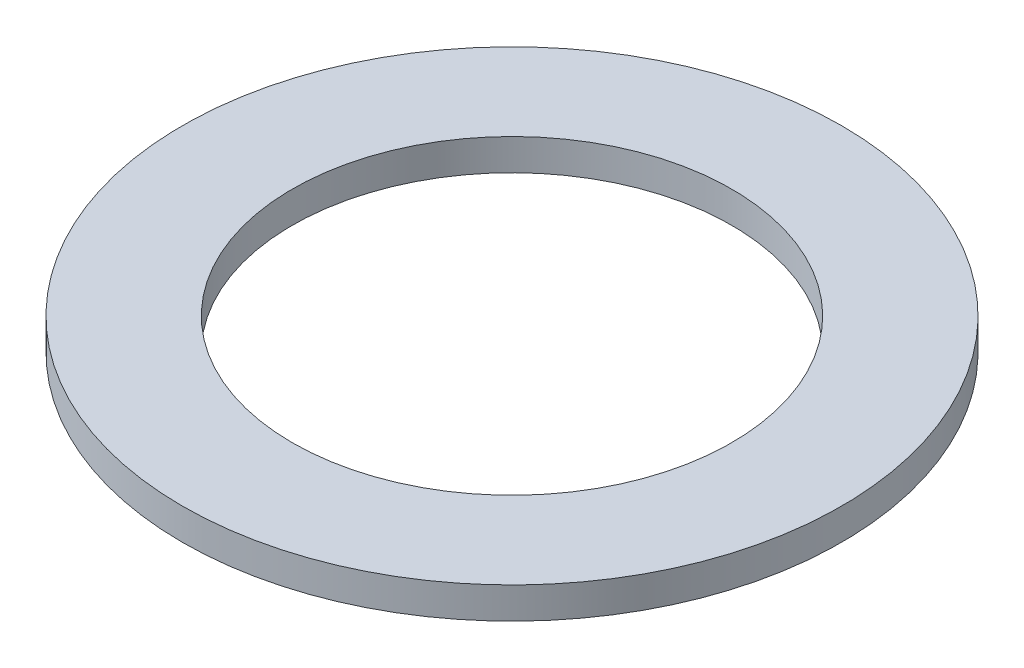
ISO-10303-21;
HEADER;
FILE_DESCRIPTION(('STEP AP214'),'2;1');
FILE_NAME('part.step','',(''),(''),'','','');
FILE_SCHEMA(('AUTOMOTIVE_DESIGN { 1 0 10303 214 1 1 1 1 }'));
ENDSEC;
DATA;
#1=APPLICATION_CONTEXT('core data for automotive mechanical design processes');
#2=APPLICATION_PROTOCOL_DEFINITION('international standard','automotive_design',2000,#1);
#3=PRODUCT_CONTEXT('',#1,'mechanical');
#4=PRODUCT('Part','Part','',(#3));
#5=PRODUCT_RELATED_PRODUCT_CATEGORY('part','',(#4));
#6=PRODUCT_DEFINITION_FORMATION('','',#4);
#7=PRODUCT_DEFINITION_CONTEXT('part definition',#1,'design');
#8=PRODUCT_DEFINITION('design','',#6,#7);
#9=PRODUCT_DEFINITION_SHAPE('','',#8);
#10=(LENGTH_UNIT() NAMED_UNIT(*) SI_UNIT(.MILLI.,.METRE.));
#11=(NAMED_UNIT(*) PLANE_ANGLE_UNIT() SI_UNIT($,.RADIAN.));
#12=(NAMED_UNIT(*) SI_UNIT($,.STERADIAN.) SOLID_ANGLE_UNIT());
#13=UNCERTAINTY_MEASURE_WITH_UNIT(LENGTH_MEASURE(1.E-05),#10,'distance_accuracy_value','');
#14=(GEOMETRIC_REPRESENTATION_CONTEXT(3) GLOBAL_UNCERTAINTY_ASSIGNED_CONTEXT((#13)) GLOBAL_UNIT_ASSIGNED_CONTEXT((#10,
#11,#12)) REPRESENTATION_CONTEXT('',''));
#15=CARTESIAN_POINT('',(0.,0.,0.));
#16=DIRECTION('',(0.,0.,1.));
#17=DIRECTION('',(1.,0.,0.));
#18=AXIS2_PLACEMENT_3D('',#15,#16,#17);
#19=CARTESIAN_POINT('',(0.,28.,0.));
#20=DIRECTION('',(0.,1.,0.));
#21=DIRECTION('',(0.,0.,1.));
#22=AXIS2_PLACEMENT_3D('',#19,#20,#21);
#23=CYLINDRICAL_SURFACE('',#22,10.5);
#24=CARTESIAN_POINT('',(0.,0.,0.));
#25=DIRECTION('',(0.,1.,0.));
#26=DIRECTION('',(0.,0.,1.));
#27=AXIS2_PLACEMENT_3D('',#24,#25,#26);
#28=CIRCLE('',#27,10.5);
#29=CARTESIAN_POINT('',(0.,0.,10.5));
#30=VERTEX_POINT('',#29);
#31=EDGE_CURVE('E10',#30,#30,#28,.T.);
#32=ORIENTED_EDGE('',*,*,#31,.T.);
#33=EDGE_LOOP('',(#32));
#34=FACE_BOUND('',#33,.T.);
#35=CARTESIAN_POINT('',(0.,0.999999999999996,0.));
#36=DIRECTION('',(0.,1.,0.));
#37=DIRECTION('',(0.,0.,1.));
#38=AXIS2_PLACEMENT_3D('',#35,#36,#37);
#39=CIRCLE('',#38,10.5);
#40=CARTESIAN_POINT('',(0.,0.999999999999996,10.5));
#41=VERTEX_POINT('',#40);
#42=EDGE_CURVE('E41',#41,#41,#39,.T.);
#43=ORIENTED_EDGE('',*,*,#42,.F.);
#44=EDGE_LOOP('',(#43));
#45=FACE_BOUND('',#44,.T.);
#46=ADVANCED_FACE('F27',(#34,#45),#23,.T.);
#47=CARTESIAN_POINT('',(-7.,0.,0.));
#48=DIRECTION('',(0.,-1.,0.));
#49=DIRECTION('',(0.,0.,-1.));
#50=AXIS2_PLACEMENT_3D('',#47,#48,#49);
#51=PLANE('',#50);
#52=CARTESIAN_POINT('',(0.,0.,0.));
#53=DIRECTION('',(0.,1.,0.));
#54=DIRECTION('',(0.,0.,1.));
#55=AXIS2_PLACEMENT_3D('',#52,#53,#54);
#56=CIRCLE('',#55,7.);
#57=CARTESIAN_POINT('',(0.,0.,7.));
#58=VERTEX_POINT('',#57);
#59=EDGE_CURVE('E33',#58,#58,#56,.T.);
#60=ORIENTED_EDGE('',*,*,#59,.T.);
#61=EDGE_LOOP('',(#60));
#62=FACE_BOUND('',#61,.T.);
#63=ORIENTED_EDGE('',*,*,#31,.F.);
#64=EDGE_LOOP('',(#63));
#65=FACE_BOUND('',#64,.T.);
#66=ADVANCED_FACE('F51',(#62,#65),#51,.T.);
#67=CARTESIAN_POINT('',(0.,28.,0.));
#68=DIRECTION('',(0.,1.,0.));
#69=DIRECTION('',(0.,0.,1.));
#70=AXIS2_PLACEMENT_3D('',#67,#68,#69);
#71=CYLINDRICAL_SURFACE('',#70,7.);
#72=CARTESIAN_POINT('',(0.,0.999999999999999,0.));
#73=DIRECTION('',(0.,1.,0.));
#74=DIRECTION('',(0.,0.,1.));
#75=AXIS2_PLACEMENT_3D('',#72,#73,#74);
#76=CIRCLE('',#75,7.);
#77=CARTESIAN_POINT('',(0.,0.999999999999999,7.));
#78=VERTEX_POINT('',#77);
#79=EDGE_CURVE('E37',#78,#78,#76,.T.);
#80=ORIENTED_EDGE('',*,*,#79,.T.);
#81=EDGE_LOOP('',(#80));
#82=FACE_BOUND('',#81,.T.);
#83=ORIENTED_EDGE('',*,*,#59,.F.);
#84=EDGE_LOOP('',(#83));
#85=FACE_BOUND('',#84,.T.);
#86=ADVANCED_FACE('F55',(#82,#85),#71,.F.);
#87=CARTESIAN_POINT('',(-10.5,0.999999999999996,0.));
#88=DIRECTION('',(0.,1.,0.));
#89=DIRECTION('',(0.,0.,1.));
#90=AXIS2_PLACEMENT_3D('',#87,#88,#89);
#91=PLANE('',#90);
#92=ORIENTED_EDGE('',*,*,#42,.T.);
#93=EDGE_LOOP('',(#92));
#94=FACE_BOUND('',#93,.T.);
#95=ORIENTED_EDGE('',*,*,#79,.F.);
#96=EDGE_LOOP('',(#95));
#97=FACE_BOUND('',#96,.T.);
#98=ADVANCED_FACE('F47',(#94,#97),#91,.T.);
#99=CLOSED_SHELL('',(#46,#66,#86,#98));
#100=MANIFOLD_SOLID_BREP('B2',#99);
#101=ADVANCED_BREP_SHAPE_REPRESENTATION('',(#18,#100),#14);
#102=SHAPE_DEFINITION_REPRESENTATION(#9,#101);
ENDSEC;
END-ISO-10303-21;
